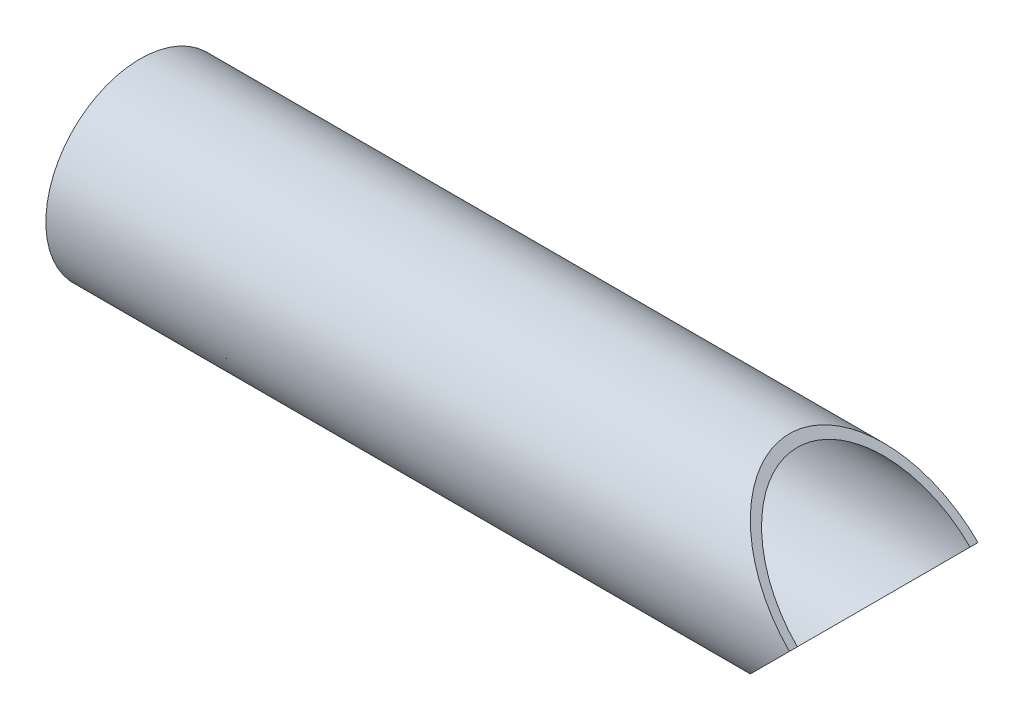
from build123d import *

# Parameters (mm, degrees)
ESQUISSE2_R             = 38.05
ESQUISSE2_R_2           = 34.85
ENL_V_MAT_EXTRU_1_DEPTH = 40


with BuildPart() as part:
    # Balayage-Mince2: sweep along a path in Esquisse1
    with BuildLine(Plane.XY) as balayage_mince2_path:
        Line((0, 0), (300, 0))
    # Esquisse2 → Balayage-Mince2 (sweep)
    with BuildSketch(Plane(origin=(300, 0, 0), x_dir=(0, 0, -1), z_dir=(1, 0, 0))):
        Circle(ESQUISSE2_R)
        Circle(ESQUISSE2_R_2, mode=Mode.SUBTRACT)
    sweep(path=balayage_mince2_path.line)

    # Esquisse5 → Enl_v. mat.-Extru.1 (cut, symmetric)
    with BuildSketch(Plane.XY):
        Polygon((300, 0), (222.223770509, -77.776229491), (309.596203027, -77.776229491), (309.596203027, 77.453084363), (222.546915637, 77.453084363), align=None)
    extrude(amount=ENL_V_MAT_EXTRU_1_DEPTH, both=True, mode=Mode.SUBTRACT)


solid = part.part
